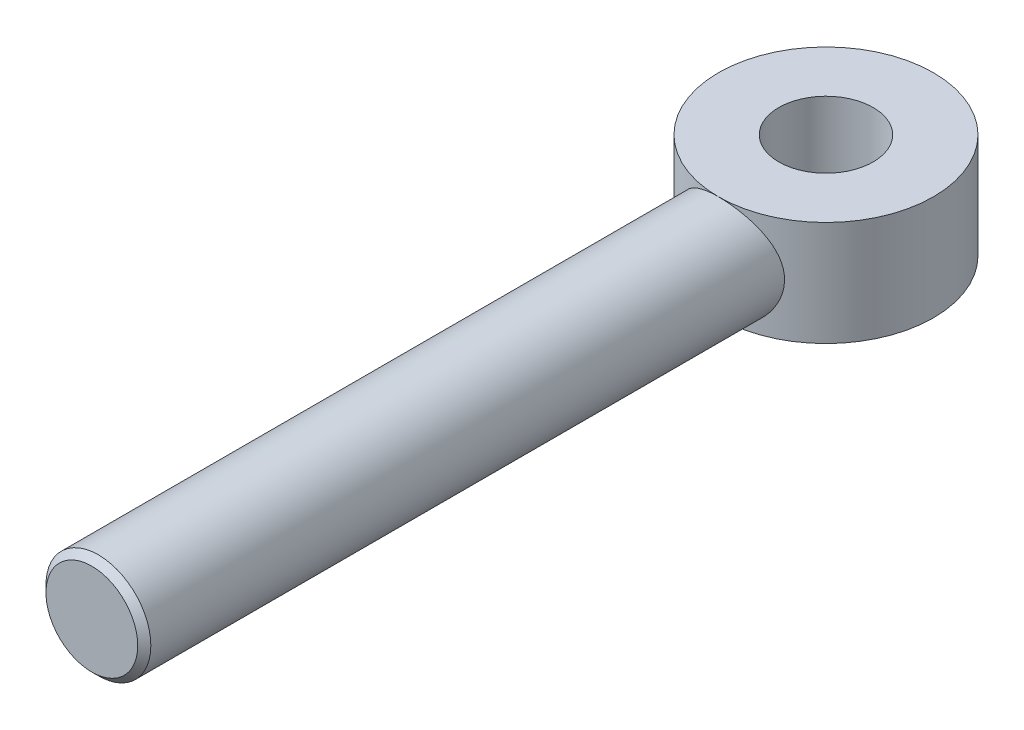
from build123d import *

# Parameters (mm, degrees)
ESQUISSE1_R             = 10
BOSS_EXTRU_1_DEPTH      = 140
CHANFREIN1_SIZE         = 1.25
ESQUISSE2_R             = 20.5
BOSS_EXTRU_2_DEPTH      = 10
ESQUISSE3_R             = 9
ENL_V_MAT_EXTRU_1_DEPTH = 143.899440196


with BuildPart() as part:
    # Esquisse1 → Boss.-Extru.1 (new body)
    with BuildSketch(Plane.XY):
        Circle(ESQUISSE1_R)
    extrude(amount=BOSS_EXTRU_1_DEPTH)

    # Chanfrein1
    chanfrein1_edges = [part.edges().sort_by_distance(p)[0] for p in [
        (-10, 0, 0),
        (-10, 0, 140),
    ]]
    chamfer(chanfrein1_edges, length=CHANFREIN1_SIZE)

    # Esquisse2 → Boss.-Extru.2 (add, symmetric)
    with BuildSketch(Plane(origin=(0, 0, 0), x_dir=(1, 0, 0), z_dir=(0, 1, 0))):
        Circle(ESQUISSE2_R)
    extrude(amount=BOSS_EXTRU_2_DEPTH, both=True)

    # Esquisse3 → Enl_v. mat.-Extru.1 (cut, through all)
    with BuildSketch(Plane(origin=(0, 10, 0), x_dir=(1, 0, 0), z_dir=(0, 1, 0))):
        with Locations(Location((0, 0, 0), (0, 0, 270))):
            Circle(ESQUISSE3_R)
    extrude(amount=-ENL_V_MAT_EXTRU_1_DEPTH, mode=Mode.SUBTRACT)


solid = part.part
